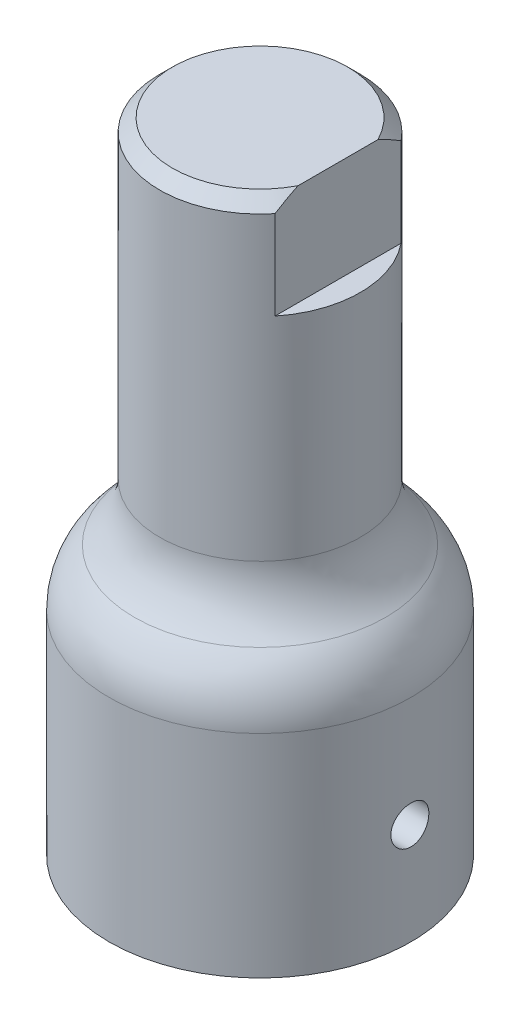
ISO-10303-21;
HEADER;
FILE_DESCRIPTION(('STEP AP214'),'2;1');
FILE_NAME('part.step','',(''),(''),'','','');
FILE_SCHEMA(('AUTOMOTIVE_DESIGN { 1 0 10303 214 1 1 1 1 }'));
ENDSEC;
DATA;
#1=APPLICATION_CONTEXT('core data for automotive mechanical design processes');
#2=APPLICATION_PROTOCOL_DEFINITION('international standard','automotive_design',2000,#1);
#3=PRODUCT_CONTEXT('',#1,'mechanical');
#4=PRODUCT('Part','Part','',(#3));
#5=PRODUCT_RELATED_PRODUCT_CATEGORY('part','',(#4));
#6=PRODUCT_DEFINITION_FORMATION('','',#4);
#7=PRODUCT_DEFINITION_CONTEXT('part definition',#1,'design');
#8=PRODUCT_DEFINITION('design','',#6,#7);
#9=PRODUCT_DEFINITION_SHAPE('','',#8);
#10=(LENGTH_UNIT() NAMED_UNIT(*) SI_UNIT(.MILLI.,.METRE.));
#11=(NAMED_UNIT(*) PLANE_ANGLE_UNIT() SI_UNIT($,.RADIAN.));
#12=(NAMED_UNIT(*) SI_UNIT($,.STERADIAN.) SOLID_ANGLE_UNIT());
#13=UNCERTAINTY_MEASURE_WITH_UNIT(LENGTH_MEASURE(1.E-05),#10,'distance_accuracy_value','');
#14=(GEOMETRIC_REPRESENTATION_CONTEXT(3) GLOBAL_UNCERTAINTY_ASSIGNED_CONTEXT((#13)) GLOBAL_UNIT_ASSIGNED_CONTEXT((#10,
#11,#12)) REPRESENTATION_CONTEXT('',''));
#15=CARTESIAN_POINT('',(0.,0.,0.));
#16=DIRECTION('',(0.,0.,1.));
#17=DIRECTION('',(1.,0.,0.));
#18=AXIS2_PLACEMENT_3D('',#15,#16,#17);
#19=CARTESIAN_POINT('',(0.,40.,0.));
#20=DIRECTION('',(0.,-1.,0.));
#21=DIRECTION('',(0.,0.,-1.));
#22=AXIS2_PLACEMENT_3D('',#19,#20,#21);
#23=CYLINDRICAL_SURFACE('',#22,6.2865);
#24=CARTESIAN_POINT('',(0.,20.3651280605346,0.));
#25=DIRECTION('',(0.,-1.,0.));
#26=DIRECTION('',(0.,0.,-1.));
#27=AXIS2_PLACEMENT_3D('',#24,#25,#26);
#28=CIRCLE('',#27,6.2865);
#29=CARTESIAN_POINT('',(0.,20.3651280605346,-6.2865));
#30=VERTEX_POINT('',#29);
#31=EDGE_CURVE('E161',#30,#30,#28,.F.);
#32=ORIENTED_EDGE('',*,*,#31,.T.);
#33=EDGE_LOOP('',(#32));
#34=FACE_BOUND('',#33,.T.);
#35=DIRECTION('',(0.,1.,0.));
#36=VECTOR('',#35,1.);
#37=CARTESIAN_POINT('',(4.8895,33.65,3.95131269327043));
#38=LINE('',#37,#36);
#39=CARTESIAN_POINT('',(4.8895,33.65,3.95131269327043));
#40=VERTEX_POINT('',#39);
#41=CARTESIAN_POINT('',(4.8895,39.20625,3.95131269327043));
#42=VERTEX_POINT('',#41);
#43=EDGE_CURVE('E83',#40,#42,#38,.T.);
#44=ORIENTED_EDGE('',*,*,#43,.T.);
#45=CARTESIAN_POINT('',(0.,39.20625,0.));
#46=DIRECTION('',(0.,1.,0.));
#47=DIRECTION('',(0.,0.,1.));
#48=AXIS2_PLACEMENT_3D('',#45,#46,#47);
#49=CIRCLE('',#48,6.2865);
#50=CARTESIAN_POINT('',(4.8895,39.20625,-3.95131269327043));
#51=VERTEX_POINT('',#50);
#52=EDGE_CURVE('E11',#42,#51,#49,.F.);
#53=ORIENTED_EDGE('',*,*,#52,.T.);
#54=DIRECTION('',(0.,1.,0.));
#55=VECTOR('',#54,1.);
#56=CARTESIAN_POINT('',(4.8895,33.65,-3.95131269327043));
#57=LINE('',#56,#55);
#58=CARTESIAN_POINT('',(4.8895,33.65,-3.95131269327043));
#59=VERTEX_POINT('',#58);
#60=EDGE_CURVE('E81',#59,#51,#57,.T.);
#61=ORIENTED_EDGE('',*,*,#60,.F.);
#62=CARTESIAN_POINT('',(0.,33.65,0.));
#63=DIRECTION('',(0.,1.,0.));
#64=DIRECTION('',(0.,0.,1.));
#65=AXIS2_PLACEMENT_3D('',#62,#63,#64);
#66=CIRCLE('',#65,6.2865);
#67=EDGE_CURVE('E86',#40,#59,#66,.T.);
#68=ORIENTED_EDGE('',*,*,#67,.F.);
#69=EDGE_LOOP('',(#44,#53,#61,#68));
#70=FACE_BOUND('',#69,.T.);
#71=ADVANCED_FACE('F34',(#34,#70),#23,.T.);
#72=CARTESIAN_POINT('',(0.,40.,0.));
#73=DIRECTION('',(0.,1.,0.));
#74=DIRECTION('',(0.,0.,1.));
#75=AXIS2_PLACEMENT_3D('',#72,#73,#74);
#76=PLANE('',#75);
#77=DIRECTION('',(0.,0.,-1.));
#78=VECTOR('',#77,1.);
#79=CARTESIAN_POINT('',(4.8895,40.,3.95131269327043));
#80=LINE('',#79,#78);
#81=CARTESIAN_POINT('',(4.8895,40.,2.50261709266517));
#82=VERTEX_POINT('',#81);
#83=CARTESIAN_POINT('',(4.8895,40.,-2.50261709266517));
#84=VERTEX_POINT('',#83);
#85=EDGE_CURVE('E89',#82,#84,#80,.T.);
#86=ORIENTED_EDGE('',*,*,#85,.T.);
#87=CARTESIAN_POINT('',(0.,40.,0.));
#88=DIRECTION('',(0.,1.,0.));
#89=DIRECTION('',(0.,0.,1.));
#90=AXIS2_PLACEMENT_3D('',#87,#88,#89);
#91=CIRCLE('',#90,5.49274999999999);
#92=EDGE_CURVE('E164',#84,#82,#91,.T.);
#93=ORIENTED_EDGE('',*,*,#92,.T.);
#94=EDGE_LOOP('',(#86,#93));
#95=FACE_BOUND('',#94,.T.);
#96=ADVANCED_FACE('F138',(#95),#76,.T.);
#97=CARTESIAN_POINT('',(0.,0.,0.));
#98=DIRECTION('',(0.,1.,0.));
#99=DIRECTION('',(0.,0.,1.));
#100=AXIS2_PLACEMENT_3D('',#97,#98,#99);
#101=PLANE('',#100);
#102=CARTESIAN_POINT('',(0.,0.,0.));
#103=DIRECTION('',(0.,1.,0.));
#104=DIRECTION('',(0.,0.,1.));
#105=AXIS2_PLACEMENT_3D('',#102,#103,#104);
#106=CIRCLE('',#105,9.4615);
#107=CARTESIAN_POINT('',(0.,0.,9.4615));
#108=VERTEX_POINT('',#107);
#109=EDGE_CURVE('E166',#108,#108,#106,.T.);
#110=ORIENTED_EDGE('',*,*,#109,.F.);
#111=EDGE_LOOP('',(#110));
#112=FACE_BOUND('',#111,.T.);
#113=CARTESIAN_POINT('',(0.,0.,0.));
#114=DIRECTION('',(0.,1.,0.));
#115=DIRECTION('',(0.,0.,1.));
#116=AXIS2_PLACEMENT_3D('',#113,#114,#115);
#117=CIRCLE('',#116,6.477);
#118=CARTESIAN_POINT('',(4.8895,0.,-4.24786049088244));
#119=VERTEX_POINT('',#118);
#120=CARTESIAN_POINT('',(4.8895,0.,4.24786049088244));
#121=VERTEX_POINT('',#120);
#122=EDGE_CURVE('E105',#119,#121,#117,.T.);
#123=ORIENTED_EDGE('',*,*,#122,.T.);
#124=DIRECTION('',(0.,0.,-1.));
#125=VECTOR('',#124,1.);
#126=CARTESIAN_POINT('',(4.8895,0.,4.24786049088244));
#127=LINE('',#126,#125);
#128=EDGE_CURVE('E234',#121,#119,#127,.T.);
#129=ORIENTED_EDGE('',*,*,#128,.T.);
#130=EDGE_LOOP('',(#123,#129));
#131=FACE_BOUND('',#130,.T.);
#132=ADVANCED_FACE('F135',(#112,#131),#101,.F.);
#133=CARTESIAN_POINT('',(0.,15.875,0.));
#134=DIRECTION('',(0.,-1.,0.));
#135=DIRECTION('',(0.,0.,-1.));
#136=AXIS2_PLACEMENT_3D('',#133,#134,#135);
#137=CYLINDRICAL_SURFACE('',#136,9.4615);
#138=CARTESIAN_POINT('',(9.4615,5.159375,0.));
#139=CARTESIAN_POINT('',(9.46149906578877,5.15937782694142,0.0665955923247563));
#140=CARTESIAN_POINT('',(9.46078946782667,5.16498120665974,0.133232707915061));
#141=CARTESIAN_POINT('',(9.45802699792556,5.18724558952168,0.264652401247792));
#142=CARTESIAN_POINT('',(9.4559727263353,5.20391811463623,0.329432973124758));
#143=CARTESIAN_POINT('',(9.45075231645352,5.24782157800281,0.455218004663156));
#144=CARTESIAN_POINT('',(9.44758692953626,5.27504538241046,0.516224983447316));
#145=CARTESIAN_POINT('',(9.44049627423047,5.33926296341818,0.632792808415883));
#146=CARTESIAN_POINT('',(9.43657113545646,5.37625507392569,0.688354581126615));
#147=CARTESIAN_POINT('',(9.42837468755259,5.4591797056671,0.792776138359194));
#148=CARTESIAN_POINT('',(9.42410175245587,5.50515581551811,0.841601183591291));
#149=CARTESIAN_POINT('',(9.41570439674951,5.60464976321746,0.930864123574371));
#150=CARTESIAN_POINT('',(9.41157998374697,5.65816798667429,0.971301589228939));
#151=CARTESIAN_POINT('',(9.40393064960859,5.77145295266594,1.04277106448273));
#152=CARTESIAN_POINT('',(9.40040782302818,5.83124040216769,1.07377049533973));
#153=CARTESIAN_POINT('',(9.3943819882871,5.95522437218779,1.12527587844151));
#154=CARTESIAN_POINT('',(9.39187894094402,6.01942072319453,1.14578223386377));
#155=CARTESIAN_POINT('',(9.38819160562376,6.15003951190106,1.17561373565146));
#156=CARTESIAN_POINT('',(9.38700039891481,6.21644834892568,1.18499756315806));
#157=CARTESIAN_POINT('',(9.38605044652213,6.34990810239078,1.19249922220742));
#158=CARTESIAN_POINT('',(9.3862916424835,6.41695899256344,1.19061751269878));
#159=CARTESIAN_POINT('',(9.38817291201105,6.54939039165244,1.17568967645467));
#160=CARTESIAN_POINT('',(9.3898048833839,6.61477832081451,1.16270821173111));
#161=CARTESIAN_POINT('',(9.394271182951,6.74244022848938,1.12605025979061));
#162=CARTESIAN_POINT('',(9.39710553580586,6.80471414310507,1.10237355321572));
#163=CARTESIAN_POINT('',(9.40366641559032,6.92458104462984,1.0449277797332));
#164=CARTESIAN_POINT('',(9.40739541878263,6.98216043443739,1.01113063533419));
#165=CARTESIAN_POINT('',(9.41532352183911,7.09085481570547,0.934423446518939));
#166=CARTESIAN_POINT('',(9.41952264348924,7.1419695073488,0.891512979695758));
#167=CARTESIAN_POINT('',(9.42795385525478,7.23665883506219,0.797438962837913));
#168=CARTESIAN_POINT('',(9.43218597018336,7.28017811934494,0.746219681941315));
#169=CARTESIAN_POINT('',(9.44017878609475,7.35801022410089,0.637173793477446));
#170=CARTESIAN_POINT('',(9.44393948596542,7.39232302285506,0.579347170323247));
#171=CARTESIAN_POINT('',(9.45056812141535,7.45076827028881,0.458685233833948));
#172=CARTESIAN_POINT('',(9.45343575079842,7.47489722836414,0.395848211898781));
#173=CARTESIAN_POINT('',(9.45795236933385,7.51224579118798,0.266970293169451));
#174=CARTESIAN_POINT('',(9.45960141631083,7.52546591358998,0.200929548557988));
#175=CARTESIAN_POINT('',(9.46148754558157,7.54054973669,0.0679974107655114));
#176=CARTESIAN_POINT('',(9.46173410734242,7.5424896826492,0.00111479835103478));
#177=CARTESIAN_POINT('',(9.46081308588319,7.53515933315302,-0.132022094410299));
#178=CARTESIAN_POINT('',(9.45964553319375,7.52588927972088,-0.198276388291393));
#179=CARTESIAN_POINT('',(9.45603338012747,7.49646541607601,-0.328050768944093));
#180=CARTESIAN_POINT('',(9.45359304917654,7.47634798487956,-0.391579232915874));
#181=CARTESIAN_POINT('',(9.44770853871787,7.4258382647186,-0.514360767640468));
#182=CARTESIAN_POINT('',(9.44426432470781,7.39544562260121,-0.573613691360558));
#183=CARTESIAN_POINT('',(9.43673237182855,7.32506391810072,-0.686502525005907));
#184=CARTESIAN_POINT('',(9.43264136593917,7.28502556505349,-0.740107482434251));
#185=CARTESIAN_POINT('',(9.42428361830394,7.19655867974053,-0.839863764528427));
#186=CARTESIAN_POINT('',(9.42001686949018,7.14812980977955,-0.886014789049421));
#187=CARTESIAN_POINT('',(9.41175925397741,7.04392064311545,-0.969823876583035));
#188=CARTESIAN_POINT('',(9.40777012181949,6.98809952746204,-1.00743138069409));
#189=CARTESIAN_POINT('',(9.40054799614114,6.87088838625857,-1.07273654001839));
#190=CARTESIAN_POINT('',(9.39731498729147,6.80949847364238,-1.10043439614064));
#191=CARTESIAN_POINT('',(9.39198299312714,6.6830551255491,-1.14505227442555));
#192=CARTESIAN_POINT('',(9.38988101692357,6.61801185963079,-1.1620007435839));
#193=CARTESIAN_POINT('',(9.38704051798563,6.48597437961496,-1.18473031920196));
#194=CARTESIAN_POINT('',(9.38630193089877,6.41898025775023,-1.19051195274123));
#195=CARTESIAN_POINT('',(9.3862737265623,6.28544580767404,-1.19073397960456));
#196=CARTESIAN_POINT('',(9.38697396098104,6.21890559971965,-1.18525380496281));
#197=CARTESIAN_POINT('',(9.3897226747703,6.08770006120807,-1.1632760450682));
#198=CARTESIAN_POINT('',(9.39177115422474,6.02303473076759,-1.14677845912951));
#199=CARTESIAN_POINT('',(9.39698239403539,5.89742536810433,-1.10325911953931));
#200=CARTESIAN_POINT('',(9.40014474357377,5.83647997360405,-1.07624124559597));
#201=CARTESIAN_POINT('',(9.40722807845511,5.7199750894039,-1.01245608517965));
#202=CARTESIAN_POINT('',(9.41114907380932,5.66441567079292,-0.975688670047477));
#203=CARTESIAN_POINT('',(9.41934102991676,5.55985390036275,-0.893153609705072));
#204=CARTESIAN_POINT('',(9.42361417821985,5.51089843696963,-0.847326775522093));
#205=CARTESIAN_POINT('',(9.43200968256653,5.4213420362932,-0.748097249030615));
#206=CARTESIAN_POINT('',(9.43613200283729,5.38074307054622,-0.694692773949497));
#207=CARTESIAN_POINT('',(9.44377893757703,5.30891871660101,-0.581587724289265));
#208=CARTESIAN_POINT('',(9.44730118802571,5.27773004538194,-0.521863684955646));
#209=CARTESIAN_POINT('',(9.45332718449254,5.22586939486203,-0.398014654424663));
#210=CARTESIAN_POINT('',(9.45583203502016,5.20518600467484,-0.333894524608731));
#211=CARTESIAN_POINT('',(9.45893817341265,5.1798660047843,-0.224536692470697));
#212=CARTESIAN_POINT('',(9.45989417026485,5.17219294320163,-0.179988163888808));
#213=CARTESIAN_POINT('',(9.46117539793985,5.16194650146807,-0.0902994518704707));
#214=CARTESIAN_POINT('',(9.46150063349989,5.15937308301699,-0.0451592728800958));
#215=CARTESIAN_POINT('',(9.4615,5.159375,0.));
#216=B_SPLINE_CURVE_WITH_KNOTS('',3,(#138,#139,#140,#141,#142,#143,#144,#145,#146,#147,#148,
#149,#150,#151,#152,#153,#154,#155,#156,#157,#158,#159,#160,#161,#162,#163,#164,#165,#166,#167,
#168,#169,#170,#171,#172,#173,#174,#175,#176,#177,#178,#179,#180,#181,#182,#183,#184,#185,#186,
#187,#188,#189,#190,#191,#192,#193,#194,#195,#196,#197,#198,#199,#200,#201,#202,#203,#204,#205,
#206,#207,#208,#209,#210,#211,#212,#213,#214,#215),.UNSPECIFIED.,.T.,.F.,(4,2,2,2,2,2,2,2,2,2,2,
2,2,2,2,2,2,2,2,2,2,2,2,2,2,2,2,2,2,2,2,2,2,2,2,2,2,2,4),(0.,0.19962182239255,0.399451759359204,
0.599146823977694,0.798807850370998,0.999462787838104,1.20012798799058,1.40147820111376,
1.60282067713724,1.80309609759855,2.00336335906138,2.20247184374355,2.40158441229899,
2.60125458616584,2.8009340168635,3.0020128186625,3.2030920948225,3.40424023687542,
3.60537883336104,3.80515629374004,4.00492944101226,4.20403673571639,4.40315087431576,
4.60330493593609,4.80346705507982,5.00478450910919,5.20609788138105,5.40687625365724,
5.60764514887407,5.80700283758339,6.00636053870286,6.20564478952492,6.40493167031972,
6.6055663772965,6.80624836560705,7.00770353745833,7.20893941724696,7.34430639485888,
7.47967235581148),.UNSPECIFIED.);
#217=CARTESIAN_POINT('',(9.4615,5.159375,0.));
#218=VERTEX_POINT('',#217);
#219=EDGE_CURVE('E98',#218,#218,#216,.T.);
#220=ORIENTED_EDGE('',*,*,#219,.T.);
#221=EDGE_LOOP('',(#220));
#222=FACE_BOUND('',#221,.T.);
#223=CARTESIAN_POINT('',(0.,13.2656122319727,0.));
#224=DIRECTION('',(0.,-1.,0.));
#225=DIRECTION('',(0.,0.,-1.));
#226=AXIS2_PLACEMENT_3D('',#223,#224,#225);
#227=CIRCLE('',#226,9.4615);
#228=CARTESIAN_POINT('',(0.,13.2656122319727,-9.4615));
#229=VERTEX_POINT('',#228);
#230=EDGE_CURVE('E157',#229,#229,#227,.T.);
#231=ORIENTED_EDGE('',*,*,#230,.T.);
#232=EDGE_LOOP('',(#231));
#233=FACE_BOUND('',#232,.T.);
#234=ORIENTED_EDGE('',*,*,#109,.T.);
#235=EDGE_LOOP('',(#234));
#236=FACE_BOUND('',#235,.T.);
#237=ADVANCED_FACE('F108',(#222,#233,#236),#137,.T.);
#238=CARTESIAN_POINT('',(0.,12.7,0.));
#239=DIRECTION('',(0.,-1.,0.));
#240=DIRECTION('',(0.,0.,-1.));
#241=AXIS2_PLACEMENT_3D('',#238,#239,#240);
#242=CYLINDRICAL_SURFACE('',#241,6.477);
#243=ORIENTED_EDGE('',*,*,#122,.F.);
#244=DIRECTION('',(0.,-1.,0.));
#245=VECTOR('',#244,1.);
#246=CARTESIAN_POINT('',(4.8895,12.7,-4.24786049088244));
#247=LINE('',#246,#245);
#248=CARTESIAN_POINT('',(4.8895,12.7,-4.24786049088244));
#249=VERTEX_POINT('',#248);
#250=EDGE_CURVE('E244',#249,#119,#247,.T.);
#251=ORIENTED_EDGE('',*,*,#250,.F.);
#252=CARTESIAN_POINT('',(0.,12.7,0.));
#253=DIRECTION('',(0.,1.,0.));
#254=DIRECTION('',(0.,0.,1.));
#255=AXIS2_PLACEMENT_3D('',#252,#253,#254);
#256=CIRCLE('',#255,6.477);
#257=CARTESIAN_POINT('',(4.8895,12.7,4.24786049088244));
#258=VERTEX_POINT('',#257);
#259=EDGE_CURVE('E106',#249,#258,#256,.T.);
#260=ORIENTED_EDGE('',*,*,#259,.T.);
#261=DIRECTION('',(0.,-1.,0.));
#262=VECTOR('',#261,1.);
#263=CARTESIAN_POINT('',(4.8895,12.7,4.24786049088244));
#264=LINE('',#263,#262);
#265=EDGE_CURVE('E247',#258,#121,#264,.T.);
#266=ORIENTED_EDGE('',*,*,#265,.T.);
#267=EDGE_LOOP('',(#243,#251,#260,#266));
#268=FACE_BOUND('',#267,.T.);
#269=ADVANCED_FACE('F128',(#268),#242,.F.);
#270=CARTESIAN_POINT('',(4.8895,12.7,4.24786049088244));
#271=DIRECTION('',(-1.,0.,0.));
#272=DIRECTION('',(0.,0.,1.));
#273=AXIS2_PLACEMENT_3D('',#270,#271,#272);
#274=PLANE('',#273);
#275=CARTESIAN_POINT('',(4.8895,6.35,0.));
#276=DIRECTION('',(-1.,0.,0.));
#277=DIRECTION('',(0.,0.,1.));
#278=AXIS2_PLACEMENT_3D('',#275,#276,#277);
#279=CIRCLE('',#278,1.190625);
#280=CARTESIAN_POINT('',(4.8895,6.35,1.190625));
#281=VERTEX_POINT('',#280);
#282=EDGE_CURVE('E92',#281,#281,#279,.T.);
#283=ORIENTED_EDGE('',*,*,#282,.F.);
#284=EDGE_LOOP('',(#283));
#285=FACE_BOUND('',#284,.T.);
#286=ORIENTED_EDGE('',*,*,#128,.F.);
#287=ORIENTED_EDGE('',*,*,#265,.F.);
#288=DIRECTION('',(0.,0.,-1.));
#289=VECTOR('',#288,1.);
#290=CARTESIAN_POINT('',(4.8895,12.7,4.24786049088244));
#291=LINE('',#290,#289);
#292=EDGE_CURVE('E241',#258,#249,#291,.T.);
#293=ORIENTED_EDGE('',*,*,#292,.T.);
#294=ORIENTED_EDGE('',*,*,#250,.T.);
#295=EDGE_LOOP('',(#286,#287,#293,#294));
#296=FACE_BOUND('',#295,.T.);
#297=ADVANCED_FACE('F125',(#285,#296),#274,.T.);
#298=CARTESIAN_POINT('',(0.,12.7,0.));
#299=DIRECTION('',(0.,1.,0.));
#300=DIRECTION('',(0.,0.,1.));
#301=AXIS2_PLACEMENT_3D('',#298,#299,#300);
#302=PLANE('',#301);
#303=ORIENTED_EDGE('',*,*,#259,.F.);
#304=ORIENTED_EDGE('',*,*,#292,.F.);
#305=EDGE_LOOP('',(#303,#304));
#306=FACE_BOUND('',#305,.T.);
#307=ADVANCED_FACE('F121',(#306),#302,.F.);
#308=CARTESIAN_POINT('',(0.,20.3651280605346,0.));
#309=DIRECTION('',(0.,-1.,0.));
#310=DIRECTION('',(0.,0.,-1.));
#311=AXIS2_PLACEMENT_3D('',#308,#309,#310);
#312=TOROIDAL_SURFACE('',#311,11.049,4.7625);
#313=CARTESIAN_POINT('',(0.,16.8153701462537,0.));
#314=DIRECTION('',(0.,1.,0.));
#315=DIRECTION('',(0.,0.,1.));
#316=AXIS2_PLACEMENT_3D('',#313,#314,#315);
#317=CIRCLE('',#316,7.874);
#318=CARTESIAN_POINT('',(0.,16.8153701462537,7.874));
#319=VERTEX_POINT('',#318);
#320=EDGE_CURVE('E160',#319,#319,#317,.T.);
#321=ORIENTED_EDGE('',*,*,#320,.T.);
#322=EDGE_LOOP('',(#321));
#323=FACE_BOUND('',#322,.T.);
#324=ORIENTED_EDGE('',*,*,#31,.F.);
#325=EDGE_LOOP('',(#324));
#326=FACE_BOUND('',#325,.T.);
#327=ADVANCED_FACE('F124',(#323,#326),#312,.F.);
#328=CARTESIAN_POINT('',(0.,13.2656122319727,0.));
#329=DIRECTION('',(0.,-1.,0.));
#330=DIRECTION('',(0.,0.,-1.));
#331=AXIS2_PLACEMENT_3D('',#328,#329,#330);
#332=DEGENERATE_TOROIDAL_SURFACE('',#331,4.699,4.7625,.T.);
#333=ORIENTED_EDGE('',*,*,#230,.F.);
#334=EDGE_LOOP('',(#333));
#335=FACE_BOUND('',#334,.T.);
#336=ORIENTED_EDGE('',*,*,#320,.F.);
#337=EDGE_LOOP('',(#336));
#338=FACE_BOUND('',#337,.T.);
#339=ADVANCED_FACE('F117',(#335,#338),#332,.T.);
#340=CARTESIAN_POINT('',(9.4615,6.35,0.));
#341=DIRECTION('',(-1.,0.,0.));
#342=DIRECTION('',(0.,0.,1.));
#343=AXIS2_PLACEMENT_3D('',#340,#341,#342);
#344=CYLINDRICAL_SURFACE('',#343,1.190625);
#345=ORIENTED_EDGE('',*,*,#282,.T.);
#346=EDGE_LOOP('',(#345));
#347=FACE_BOUND('',#346,.T.);
#348=ORIENTED_EDGE('',*,*,#219,.F.);
#349=EDGE_LOOP('',(#348));
#350=FACE_BOUND('',#349,.T.);
#351=ADVANCED_FACE('F112',(#347,#350),#344,.F.);
#352=CARTESIAN_POINT('',(4.8895,33.65,3.95131269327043));
#353=DIRECTION('',(1.,0.,0.));
#354=DIRECTION('',(0.,0.,-1.));
#355=AXIS2_PLACEMENT_3D('',#352,#353,#354);
#356=PLANE('',#355);
#357=ORIENTED_EDGE('',*,*,#85,.F.);
#358=CARTESIAN_POINT('',(4.8895,40.,2.50261709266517));
#359=CARTESIAN_POINT('',(4.8895,39.9428169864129,2.62807233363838));
#360=CARTESIAN_POINT('',(4.8895,39.8828658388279,2.75222812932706));
#361=CARTESIAN_POINT('',(4.8895,39.7582936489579,2.9980084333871));
#362=CARTESIAN_POINT('',(4.8895,39.6936778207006,3.11963557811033));
#363=CARTESIAN_POINT('',(4.8895,39.5605287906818,3.36067333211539));
#364=CARTESIAN_POINT('',(4.8895,39.4919965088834,3.48008445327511));
#365=CARTESIAN_POINT('',(4.8895,39.351519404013,3.7170633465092));
#366=CARTESIAN_POINT('',(4.8895,39.2795709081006,3.83462894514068));
#367=CARTESIAN_POINT('',(4.8895,39.20625,3.95131269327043));
#368=B_SPLINE_CURVE_WITH_KNOTS('',3,(#358,#359,#360,#361,#362,#363,#364,#365,#366,#367),
.UNSPECIFIED.,.F.,.F.,(4,2,2,2,4),(0.,0.413535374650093,0.826615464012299,1.23959891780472,
1.6530369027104),.UNSPECIFIED.);
#369=EDGE_CURVE('E43',#82,#42,#368,.T.);
#370=ORIENTED_EDGE('',*,*,#369,.T.);
#371=ORIENTED_EDGE('',*,*,#43,.F.);
#372=DIRECTION('',(0.,0.,-1.));
#373=VECTOR('',#372,1.);
#374=CARTESIAN_POINT('',(4.8895,33.65,3.95131269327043));
#375=LINE('',#374,#373);
#376=EDGE_CURVE('E78',#40,#59,#375,.T.);
#377=ORIENTED_EDGE('',*,*,#376,.T.);
#378=ORIENTED_EDGE('',*,*,#60,.T.);
#379=CARTESIAN_POINT('',(4.8895,39.20625,-3.95131269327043));
#380=CARTESIAN_POINT('',(4.8895,39.2795709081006,-3.83462894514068));
#381=CARTESIAN_POINT('',(4.8895,39.351519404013,-3.7170633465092));
#382=CARTESIAN_POINT('',(4.8895,39.4919965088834,-3.48008445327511));
#383=CARTESIAN_POINT('',(4.8895,39.5605287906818,-3.36067333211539));
#384=CARTESIAN_POINT('',(4.8895,39.6936778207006,-3.11963557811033));
#385=CARTESIAN_POINT('',(4.8895,39.7582936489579,-2.9980084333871));
#386=CARTESIAN_POINT('',(4.8895,39.8828658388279,-2.75222812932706));
#387=CARTESIAN_POINT('',(4.8895,39.9428169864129,-2.62807233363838));
#388=CARTESIAN_POINT('',(4.8895,40.,-2.50261709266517));
#389=B_SPLINE_CURVE_WITH_KNOTS('',3,(#379,#380,#381,#382,#383,#384,#385,#386,#387,#388),
.UNSPECIFIED.,.F.,.F.,(4,2,2,2,4),(0.,0.41343798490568,0.826421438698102,1.23950152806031,
1.6530369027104),.UNSPECIFIED.);
#390=EDGE_CURVE('E172',#51,#84,#389,.T.);
#391=ORIENTED_EDGE('',*,*,#390,.T.);
#392=EDGE_LOOP('',(#357,#370,#371,#377,#378,#391));
#393=FACE_BOUND('',#392,.T.);
#394=ADVANCED_FACE('F80',(#393),#356,.T.);
#395=CARTESIAN_POINT('',(0.,33.65,0.));
#396=DIRECTION('',(0.,1.,0.));
#397=DIRECTION('',(0.,0.,1.));
#398=AXIS2_PLACEMENT_3D('',#395,#396,#397);
#399=PLANE('',#398);
#400=ORIENTED_EDGE('',*,*,#67,.T.);
#401=ORIENTED_EDGE('',*,*,#376,.F.);
#402=EDGE_LOOP('',(#400,#401));
#403=FACE_BOUND('',#402,.T.);
#404=ADVANCED_FACE('F88',(#403),#399,.T.);
#405=CARTESIAN_POINT('',(0.,40.,0.));
#406=DIRECTION('',(0.,-1.,0.));
#407=DIRECTION('',(0.,0.,-1.));
#408=AXIS2_PLACEMENT_3D('',#405,#406,#407);
#409=CONICAL_SURFACE('',#408,5.49274999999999,0.785398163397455);
#410=ORIENTED_EDGE('',*,*,#390,.F.);
#411=ORIENTED_EDGE('',*,*,#52,.F.);
#412=ORIENTED_EDGE('',*,*,#369,.F.);
#413=ORIENTED_EDGE('',*,*,#92,.F.);
#414=EDGE_LOOP('',(#410,#411,#412,#413));
#415=FACE_BOUND('',#414,.T.);
#416=ADVANCED_FACE('F36',(#415),#409,.T.);
#417=CLOSED_SHELL('',(#71,#96,#132,#237,#269,#297,#307,#327,#339,#351,#394,#404,#416));
#418=MANIFOLD_SOLID_BREP('B2',#417);
#419=ADVANCED_BREP_SHAPE_REPRESENTATION('',(#18,#418),#14);
#420=SHAPE_DEFINITION_REPRESENTATION(#9,#419);
ENDSEC;
END-ISO-10303-21;
